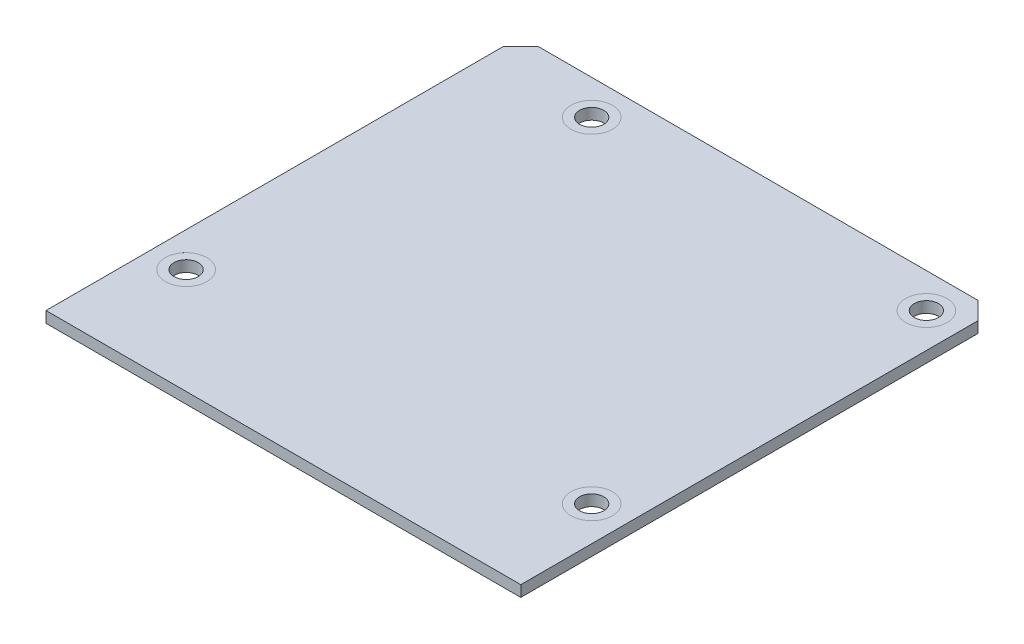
ISO-10303-21;
HEADER;
FILE_DESCRIPTION(('STEP AP214'),'2;1');
FILE_NAME('part.step','',(''),(''),'','','');
FILE_SCHEMA(('AUTOMOTIVE_DESIGN { 1 0 10303 214 1 1 1 1 }'));
ENDSEC;
DATA;
#1=APPLICATION_CONTEXT('core data for automotive mechanical design processes');
#2=APPLICATION_PROTOCOL_DEFINITION('international standard','automotive_design',2000,#1);
#3=PRODUCT_CONTEXT('',#1,'mechanical');
#4=PRODUCT('Part','Part','',(#3));
#5=PRODUCT_RELATED_PRODUCT_CATEGORY('part','',(#4));
#6=PRODUCT_DEFINITION_FORMATION('','',#4);
#7=PRODUCT_DEFINITION_CONTEXT('part definition',#1,'design');
#8=PRODUCT_DEFINITION('design','',#6,#7);
#9=PRODUCT_DEFINITION_SHAPE('','',#8);
#10=(LENGTH_UNIT() NAMED_UNIT(*) SI_UNIT(.MILLI.,.METRE.));
#11=(NAMED_UNIT(*) PLANE_ANGLE_UNIT() SI_UNIT($,.RADIAN.));
#12=(NAMED_UNIT(*) SI_UNIT($,.STERADIAN.) SOLID_ANGLE_UNIT());
#13=UNCERTAINTY_MEASURE_WITH_UNIT(LENGTH_MEASURE(1.E-05),#10,'distance_accuracy_value','');
#14=(GEOMETRIC_REPRESENTATION_CONTEXT(3) GLOBAL_UNCERTAINTY_ASSIGNED_CONTEXT((#13)) GLOBAL_UNIT_ASSIGNED_CONTEXT((#10,
#11,#12)) REPRESENTATION_CONTEXT('',''));
#15=CARTESIAN_POINT('',(0.,0.,0.));
#16=DIRECTION('',(0.,0.,1.));
#17=DIRECTION('',(1.,0.,0.));
#18=AXIS2_PLACEMENT_3D('',#15,#16,#17);
#19=CARTESIAN_POINT('',(29.29,-0.000999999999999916,19.05));
#20=DIRECTION('',(0.,1.,0.));
#21=DIRECTION('',(0.,0.,1.));
#22=AXIS2_PLACEMENT_3D('',#19,#20,#21);
#23=CYLINDRICAL_SURFACE('',#22,1.75);
#24=CARTESIAN_POINT('',(29.29,0.,19.05));
#25=DIRECTION('',(0.,1.,0.));
#26=DIRECTION('',(0.,0.,1.));
#27=AXIS2_PLACEMENT_3D('',#24,#25,#26);
#28=CIRCLE('',#27,1.75);
#29=CARTESIAN_POINT('',(29.29,0.,20.8));
#30=VERTEX_POINT('',#29);
#31=EDGE_CURVE('E169',#30,#30,#28,.F.);
#32=ORIENTED_EDGE('',*,*,#31,.T.);
#33=EDGE_LOOP('',(#32));
#34=FACE_BOUND('',#33,.T.);
#35=CARTESIAN_POINT('',(29.29,1.5999,19.05));
#36=DIRECTION('',(0.,1.,0.));
#37=DIRECTION('',(0.,0.,1.));
#38=AXIS2_PLACEMENT_3D('',#35,#36,#37);
#39=CIRCLE('',#38,1.75);
#40=CARTESIAN_POINT('',(29.29,1.5999,20.8));
#41=VERTEX_POINT('',#40);
#42=EDGE_CURVE('E35',#41,#41,#39,.F.);
#43=ORIENTED_EDGE('',*,*,#42,.F.);
#44=EDGE_LOOP('',(#43));
#45=FACE_BOUND('',#44,.T.);
#46=ADVANCED_FACE('F31',(#34,#45),#23,.F.);
#47=CARTESIAN_POINT('',(-29.29,-0.000999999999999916,19.05));
#48=DIRECTION('',(0.,1.,0.));
#49=DIRECTION('',(0.,0.,1.));
#50=AXIS2_PLACEMENT_3D('',#47,#48,#49);
#51=CYLINDRICAL_SURFACE('',#50,1.75);
#52=CARTESIAN_POINT('',(-29.29,0.,19.05));
#53=DIRECTION('',(0.,1.,0.));
#54=DIRECTION('',(0.,0.,1.));
#55=AXIS2_PLACEMENT_3D('',#52,#53,#54);
#56=CIRCLE('',#55,1.75);
#57=CARTESIAN_POINT('',(-29.29,0.,20.8));
#58=VERTEX_POINT('',#57);
#59=EDGE_CURVE('E136',#58,#58,#56,.F.);
#60=ORIENTED_EDGE('',*,*,#59,.T.);
#61=EDGE_LOOP('',(#60));
#62=FACE_BOUND('',#61,.T.);
#63=CARTESIAN_POINT('',(-29.29,1.5999,19.05));
#64=DIRECTION('',(0.,1.,0.));
#65=DIRECTION('',(0.,0.,1.));
#66=AXIS2_PLACEMENT_3D('',#63,#64,#65);
#67=CIRCLE('',#66,1.75);
#68=CARTESIAN_POINT('',(-29.29,1.5999,20.8));
#69=VERTEX_POINT('',#68);
#70=EDGE_CURVE('E142',#69,#69,#67,.F.);
#71=ORIENTED_EDGE('',*,*,#70,.F.);
#72=EDGE_LOOP('',(#71));
#73=FACE_BOUND('',#72,.T.);
#74=ADVANCED_FACE('F201',(#62,#73),#51,.F.);
#75=CARTESIAN_POINT('',(29.29,-0.000999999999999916,-29.29));
#76=DIRECTION('',(0.,1.,0.));
#77=DIRECTION('',(0.,0.,1.));
#78=AXIS2_PLACEMENT_3D('',#75,#76,#77);
#79=CYLINDRICAL_SURFACE('',#78,1.75);
#80=CARTESIAN_POINT('',(29.29,0.,-29.29));
#81=DIRECTION('',(0.,1.,0.));
#82=DIRECTION('',(0.,0.,1.));
#83=AXIS2_PLACEMENT_3D('',#80,#81,#82);
#84=CIRCLE('',#83,1.75);
#85=CARTESIAN_POINT('',(29.29,0.,-27.54));
#86=VERTEX_POINT('',#85);
#87=EDGE_CURVE('E172',#86,#86,#84,.F.);
#88=ORIENTED_EDGE('',*,*,#87,.T.);
#89=EDGE_LOOP('',(#88));
#90=FACE_BOUND('',#89,.T.);
#91=CARTESIAN_POINT('',(29.29,1.5999,-29.29));
#92=DIRECTION('',(0.,1.,0.));
#93=DIRECTION('',(0.,0.,1.));
#94=AXIS2_PLACEMENT_3D('',#91,#92,#93);
#95=CIRCLE('',#94,1.75);
#96=CARTESIAN_POINT('',(29.29,1.5999,-27.54));
#97=VERTEX_POINT('',#96);
#98=EDGE_CURVE('E138',#97,#97,#95,.F.);
#99=ORIENTED_EDGE('',*,*,#98,.F.);
#100=EDGE_LOOP('',(#99));
#101=FACE_BOUND('',#100,.T.);
#102=ADVANCED_FACE('F207',(#90,#101),#79,.F.);
#103=CARTESIAN_POINT('',(-19.05,-0.000999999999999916,-29.29));
#104=DIRECTION('',(0.,1.,0.));
#105=DIRECTION('',(0.,0.,1.));
#106=AXIS2_PLACEMENT_3D('',#103,#104,#105);
#107=CYLINDRICAL_SURFACE('',#106,1.75);
#108=CARTESIAN_POINT('',(-19.05,0.,-29.29));
#109=DIRECTION('',(0.,1.,0.));
#110=DIRECTION('',(0.,0.,1.));
#111=AXIS2_PLACEMENT_3D('',#108,#109,#110);
#112=CIRCLE('',#111,1.75);
#113=CARTESIAN_POINT('',(-19.05,0.,-27.54));
#114=VERTEX_POINT('',#113);
#115=EDGE_CURVE('E115',#114,#114,#112,.F.);
#116=ORIENTED_EDGE('',*,*,#115,.T.);
#117=EDGE_LOOP('',(#116));
#118=FACE_BOUND('',#117,.T.);
#119=CARTESIAN_POINT('',(-19.05,1.5999,-29.29));
#120=DIRECTION('',(0.,1.,0.));
#121=DIRECTION('',(0.,0.,1.));
#122=AXIS2_PLACEMENT_3D('',#119,#120,#121);
#123=CIRCLE('',#122,1.75);
#124=CARTESIAN_POINT('',(-19.05,1.5999,-27.54));
#125=VERTEX_POINT('',#124);
#126=EDGE_CURVE('E133',#125,#125,#123,.F.);
#127=ORIENTED_EDGE('',*,*,#126,.F.);
#128=EDGE_LOOP('',(#127));
#129=FACE_BOUND('',#128,.T.);
#130=ADVANCED_FACE('F198',(#118,#129),#107,.F.);
#131=CARTESIAN_POINT('',(34.29,1.6,-34.29));
#132=DIRECTION('',(-1.,0.,0.));
#133=DIRECTION('',(0.,0.,1.));
#134=AXIS2_PLACEMENT_3D('',#131,#132,#133);
#135=PLANE('',#134);
#136=DIRECTION('',(0.,0.,-1.));
#137=VECTOR('',#136,1.);
#138=CARTESIAN_POINT('',(34.29,0.,-34.29));
#139=LINE('',#138,#137);
#140=CARTESIAN_POINT('',(34.29,0.,34.29));
#141=VERTEX_POINT('',#140);
#142=CARTESIAN_POINT('',(34.29,0.,-31.75));
#143=VERTEX_POINT('',#142);
#144=EDGE_CURVE('E112',#141,#143,#139,.T.);
#145=ORIENTED_EDGE('',*,*,#144,.T.);
#146=DIRECTION('',(0.,1.,0.));
#147=VECTOR('',#146,1.);
#148=CARTESIAN_POINT('',(34.29,1.6,-31.75));
#149=LINE('',#148,#147);
#150=CARTESIAN_POINT('',(34.29,1.6,-31.75));
#151=VERTEX_POINT('',#150);
#152=EDGE_CURVE('E56',#143,#151,#149,.T.);
#153=ORIENTED_EDGE('',*,*,#152,.T.);
#154=DIRECTION('',(0.,0.,-1.));
#155=VECTOR('',#154,1.);
#156=CARTESIAN_POINT('',(34.29,1.6,-34.29));
#157=LINE('',#156,#155);
#158=CARTESIAN_POINT('',(34.29,1.6,34.29));
#159=VERTEX_POINT('',#158);
#160=EDGE_CURVE('E120',#159,#151,#157,.T.);
#161=ORIENTED_EDGE('',*,*,#160,.F.);
#162=DIRECTION('',(0.,-1.,0.));
#163=VECTOR('',#162,1.);
#164=CARTESIAN_POINT('',(34.29,1.6,34.29));
#165=LINE('',#164,#163);
#166=EDGE_CURVE('E104',#159,#141,#165,.T.);
#167=ORIENTED_EDGE('',*,*,#166,.T.);
#168=EDGE_LOOP('',(#145,#153,#161,#167));
#169=FACE_BOUND('',#168,.T.);
#170=ADVANCED_FACE('F187',(#169),#135,.F.);
#171=CARTESIAN_POINT('',(-34.29,1.6,-34.29));
#172=DIRECTION('',(0.,0.,1.));
#173=DIRECTION('',(1.,0.,0.));
#174=AXIS2_PLACEMENT_3D('',#171,#172,#173);
#175=PLANE('',#174);
#176=DIRECTION('',(-1.,0.,0.));
#177=VECTOR('',#176,1.);
#178=CARTESIAN_POINT('',(-34.29,1.6,-34.29));
#179=LINE('',#178,#177);
#180=CARTESIAN_POINT('',(31.75,1.6,-34.29));
#181=VERTEX_POINT('',#180);
#182=CARTESIAN_POINT('',(-31.75,1.6,-34.29));
#183=VERTEX_POINT('',#182);
#184=EDGE_CURVE('E94',#181,#183,#179,.T.);
#185=ORIENTED_EDGE('',*,*,#184,.F.);
#186=DIRECTION('',(0.,-1.,0.));
#187=VECTOR('',#186,1.);
#188=CARTESIAN_POINT('',(31.75,1.6,-34.29));
#189=LINE('',#188,#187);
#190=CARTESIAN_POINT('',(31.75,0.,-34.29));
#191=VERTEX_POINT('',#190);
#192=EDGE_CURVE('E123',#181,#191,#189,.T.);
#193=ORIENTED_EDGE('',*,*,#192,.T.);
#194=DIRECTION('',(-1.,0.,0.));
#195=VECTOR('',#194,1.);
#196=CARTESIAN_POINT('',(-34.29,0.,-34.29));
#197=LINE('',#196,#195);
#198=CARTESIAN_POINT('',(-31.75,0.,-34.29));
#199=VERTEX_POINT('',#198);
#200=EDGE_CURVE('E114',#191,#199,#197,.T.);
#201=ORIENTED_EDGE('',*,*,#200,.T.);
#202=DIRECTION('',(0.,1.,0.));
#203=VECTOR('',#202,1.);
#204=CARTESIAN_POINT('',(-31.75,1.6,-34.29));
#205=LINE('',#204,#203);
#206=EDGE_CURVE('E103',#199,#183,#205,.T.);
#207=ORIENTED_EDGE('',*,*,#206,.T.);
#208=EDGE_LOOP('',(#185,#193,#201,#207));
#209=FACE_BOUND('',#208,.T.);
#210=ADVANCED_FACE('F190',(#209),#175,.F.);
#211=CARTESIAN_POINT('',(-34.29,1.6,-34.29));
#212=DIRECTION('',(1.,0.,0.));
#213=DIRECTION('',(0.,0.,-1.));
#214=AXIS2_PLACEMENT_3D('',#211,#212,#213);
#215=PLANE('',#214);
#216=DIRECTION('',(0.,0.,1.));
#217=VECTOR('',#216,1.);
#218=CARTESIAN_POINT('',(-34.29,1.6,-34.29));
#219=LINE('',#218,#217);
#220=CARTESIAN_POINT('',(-34.29,1.6,-31.75));
#221=VERTEX_POINT('',#220);
#222=CARTESIAN_POINT('',(-34.29,1.6,34.29));
#223=VERTEX_POINT('',#222);
#224=EDGE_CURVE('E86',#221,#223,#219,.T.);
#225=ORIENTED_EDGE('',*,*,#224,.F.);
#226=DIRECTION('',(0.,-1.,0.));
#227=VECTOR('',#226,1.);
#228=CARTESIAN_POINT('',(-34.29,1.6,-31.75));
#229=LINE('',#228,#227);
#230=CARTESIAN_POINT('',(-34.29,0.,-31.75));
#231=VERTEX_POINT('',#230);
#232=EDGE_CURVE('E11',#221,#231,#229,.T.);
#233=ORIENTED_EDGE('',*,*,#232,.T.);
#234=DIRECTION('',(0.,0.,1.));
#235=VECTOR('',#234,1.);
#236=CARTESIAN_POINT('',(-34.29,0.,-34.29));
#237=LINE('',#236,#235);
#238=CARTESIAN_POINT('',(-34.29,0.,34.29));
#239=VERTEX_POINT('',#238);
#240=EDGE_CURVE('E100',#231,#239,#237,.T.);
#241=ORIENTED_EDGE('',*,*,#240,.T.);
#242=DIRECTION('',(0.,-1.,0.));
#243=VECTOR('',#242,1.);
#244=CARTESIAN_POINT('',(-34.29,1.6,34.29));
#245=LINE('',#244,#243);
#246=EDGE_CURVE('E97',#223,#239,#245,.T.);
#247=ORIENTED_EDGE('',*,*,#246,.F.);
#248=EDGE_LOOP('',(#225,#233,#241,#247));
#249=FACE_BOUND('',#248,.T.);
#250=ADVANCED_FACE('F98',(#249),#215,.F.);
#251=CARTESIAN_POINT('',(-34.29,1.6,34.29));
#252=DIRECTION('',(0.,0.,-1.));
#253=DIRECTION('',(-1.,0.,0.));
#254=AXIS2_PLACEMENT_3D('',#251,#252,#253);
#255=PLANE('',#254);
#256=DIRECTION('',(1.,0.,0.));
#257=VECTOR('',#256,1.);
#258=CARTESIAN_POINT('',(-34.29,0.,34.29));
#259=LINE('',#258,#257);
#260=EDGE_CURVE('E119',#239,#141,#259,.T.);
#261=ORIENTED_EDGE('',*,*,#260,.T.);
#262=ORIENTED_EDGE('',*,*,#166,.F.);
#263=DIRECTION('',(1.,0.,0.));
#264=VECTOR('',#263,1.);
#265=CARTESIAN_POINT('',(-34.29,1.6,34.29));
#266=LINE('',#265,#264);
#267=EDGE_CURVE('E90',#223,#159,#266,.T.);
#268=ORIENTED_EDGE('',*,*,#267,.F.);
#269=ORIENTED_EDGE('',*,*,#246,.T.);
#270=EDGE_LOOP('',(#261,#262,#268,#269));
#271=FACE_BOUND('',#270,.T.);
#272=ADVANCED_FACE('F106',(#271),#255,.F.);
#273=CARTESIAN_POINT('',(34.29,1.6,34.29));
#274=DIRECTION('',(0.,1.,0.));
#275=DIRECTION('',(0.,0.,1.));
#276=AXIS2_PLACEMENT_3D('',#273,#274,#275);
#277=PLANE('',#276);
#278=CARTESIAN_POINT('',(29.29,1.6,19.05));
#279=DIRECTION('',(0.,1.,0.));
#280=DIRECTION('',(0.,0.,1.));
#281=AXIS2_PLACEMENT_3D('',#278,#279,#280);
#282=CIRCLE('',#281,3.);
#283=CARTESIAN_POINT('',(29.29,1.6,22.05));
#284=VERTEX_POINT('',#283);
#285=EDGE_CURVE('E158',#284,#284,#282,.T.);
#286=ORIENTED_EDGE('',*,*,#285,.F.);
#287=EDGE_LOOP('',(#286));
#288=FACE_BOUND('',#287,.T.);
#289=CARTESIAN_POINT('',(-29.29,1.6,19.05));
#290=DIRECTION('',(0.,1.,0.));
#291=DIRECTION('',(0.,0.,1.));
#292=AXIS2_PLACEMENT_3D('',#289,#290,#291);
#293=CIRCLE('',#292,3.);
#294=CARTESIAN_POINT('',(-29.29,1.6,22.05));
#295=VERTEX_POINT('',#294);
#296=EDGE_CURVE('E151',#295,#295,#293,.T.);
#297=ORIENTED_EDGE('',*,*,#296,.F.);
#298=EDGE_LOOP('',(#297));
#299=FACE_BOUND('',#298,.T.);
#300=CARTESIAN_POINT('',(29.29,1.6,-29.29));
#301=DIRECTION('',(0.,1.,0.));
#302=DIRECTION('',(0.,0.,1.));
#303=AXIS2_PLACEMENT_3D('',#300,#301,#302);
#304=CIRCLE('',#303,3.);
#305=CARTESIAN_POINT('',(29.29,1.6,-26.29));
#306=VERTEX_POINT('',#305);
#307=EDGE_CURVE('E144',#306,#306,#304,.T.);
#308=ORIENTED_EDGE('',*,*,#307,.F.);
#309=EDGE_LOOP('',(#308));
#310=FACE_BOUND('',#309,.T.);
#311=CARTESIAN_POINT('',(-19.05,1.6,-29.29));
#312=DIRECTION('',(0.,1.,0.));
#313=DIRECTION('',(0.,0.,1.));
#314=AXIS2_PLACEMENT_3D('',#311,#312,#313);
#315=CIRCLE('',#314,3.);
#316=CARTESIAN_POINT('',(-19.05,1.6,-26.29));
#317=VERTEX_POINT('',#316);
#318=EDGE_CURVE('E140',#317,#317,#315,.T.);
#319=ORIENTED_EDGE('',*,*,#318,.F.);
#320=EDGE_LOOP('',(#319));
#321=FACE_BOUND('',#320,.T.);
#322=ORIENTED_EDGE('',*,*,#160,.T.);
#323=DIRECTION('',(0.707106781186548,0.,0.707106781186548));
#324=VECTOR('',#323,1.);
#325=CARTESIAN_POINT('',(67.31,1.6,1.27));
#326=LINE('',#325,#324);
#327=EDGE_CURVE('E40',#151,#181,#326,.F.);
#328=ORIENTED_EDGE('',*,*,#327,.T.);
#329=ORIENTED_EDGE('',*,*,#184,.T.);
#330=DIRECTION('',(0.707106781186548,0.,-0.707106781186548));
#331=VECTOR('',#330,1.);
#332=CARTESIAN_POINT('',(-33.02,1.6,-33.02));
#333=LINE('',#332,#331);
#334=EDGE_CURVE('E48',#183,#221,#333,.F.);
#335=ORIENTED_EDGE('',*,*,#334,.T.);
#336=ORIENTED_EDGE('',*,*,#224,.T.);
#337=ORIENTED_EDGE('',*,*,#267,.T.);
#338=EDGE_LOOP('',(#322,#328,#329,#335,#336,#337));
#339=FACE_BOUND('',#338,.T.);
#340=ADVANCED_FACE('F88',(#288,#299,#310,#321,#339),#277,.T.);
#341=CARTESIAN_POINT('',(34.29,0.,34.29));
#342=DIRECTION('',(0.,1.,0.));
#343=DIRECTION('',(0.,0.,1.));
#344=AXIS2_PLACEMENT_3D('',#341,#342,#343);
#345=PLANE('',#344);
#346=ORIENTED_EDGE('',*,*,#59,.F.);
#347=EDGE_LOOP('',(#346));
#348=FACE_BOUND('',#347,.T.);
#349=ORIENTED_EDGE('',*,*,#31,.F.);
#350=EDGE_LOOP('',(#349));
#351=FACE_BOUND('',#350,.T.);
#352=ORIENTED_EDGE('',*,*,#87,.F.);
#353=EDGE_LOOP('',(#352));
#354=FACE_BOUND('',#353,.T.);
#355=ORIENTED_EDGE('',*,*,#115,.F.);
#356=EDGE_LOOP('',(#355));
#357=FACE_BOUND('',#356,.T.);
#358=ORIENTED_EDGE('',*,*,#200,.F.);
#359=DIRECTION('',(-0.707106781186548,0.,-0.707106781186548));
#360=VECTOR('',#359,1.);
#361=CARTESIAN_POINT('',(31.75,0.,-34.29));
#362=LINE('',#361,#360);
#363=EDGE_CURVE('E128',#191,#143,#362,.F.);
#364=ORIENTED_EDGE('',*,*,#363,.T.);
#365=ORIENTED_EDGE('',*,*,#144,.F.);
#366=ORIENTED_EDGE('',*,*,#260,.F.);
#367=ORIENTED_EDGE('',*,*,#240,.F.);
#368=DIRECTION('',(-0.707106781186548,0.,0.707106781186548));
#369=VECTOR('',#368,1.);
#370=CARTESIAN_POINT('',(-34.29,0.,-31.75));
#371=LINE('',#370,#369);
#372=EDGE_CURVE('E126',#231,#199,#371,.F.);
#373=ORIENTED_EDGE('',*,*,#372,.T.);
#374=EDGE_LOOP('',(#358,#364,#365,#366,#367,#373));
#375=FACE_BOUND('',#374,.T.);
#376=ADVANCED_FACE('F185',(#348,#351,#354,#357,#375),#345,.F.);
#377=CARTESIAN_POINT('',(31.75,1.6,-34.29));
#378=DIRECTION('',(-0.707106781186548,0.,0.707106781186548));
#379=DIRECTION('',(0.707106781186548,0.,0.707106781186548));
#380=AXIS2_PLACEMENT_3D('',#377,#378,#379);
#381=PLANE('',#380);
#382=ORIENTED_EDGE('',*,*,#327,.F.);
#383=ORIENTED_EDGE('',*,*,#152,.F.);
#384=ORIENTED_EDGE('',*,*,#363,.F.);
#385=ORIENTED_EDGE('',*,*,#192,.F.);
#386=EDGE_LOOP('',(#382,#383,#384,#385));
#387=FACE_BOUND('',#386,.T.);
#388=ADVANCED_FACE('F189',(#387),#381,.F.);
#389=CARTESIAN_POINT('',(-34.29,1.6,-31.75));
#390=DIRECTION('',(0.707106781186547,0.,0.707106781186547));
#391=DIRECTION('',(0.707106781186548,0.,-0.707106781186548));
#392=AXIS2_PLACEMENT_3D('',#389,#390,#391);
#393=PLANE('',#392);
#394=ORIENTED_EDGE('',*,*,#334,.F.);
#395=ORIENTED_EDGE('',*,*,#206,.F.);
#396=ORIENTED_EDGE('',*,*,#372,.F.);
#397=ORIENTED_EDGE('',*,*,#232,.F.);
#398=EDGE_LOOP('',(#394,#395,#396,#397));
#399=FACE_BOUND('',#398,.T.);
#400=ADVANCED_FACE('F33',(#399),#393,.F.);
#401=CARTESIAN_POINT('',(-19.05,1.5999,-29.29));
#402=DIRECTION('',(0.,1.,0.));
#403=DIRECTION('',(0.,0.,1.));
#404=AXIS2_PLACEMENT_3D('',#401,#402,#403);
#405=PLANE('',#404);
#406=CARTESIAN_POINT('',(-19.05,1.5999,-29.29));
#407=DIRECTION('',(0.,1.,0.));
#408=DIRECTION('',(0.,0.,1.));
#409=AXIS2_PLACEMENT_3D('',#406,#407,#408);
#410=CIRCLE('',#409,3.);
#411=CARTESIAN_POINT('',(-19.05,1.5999,-26.29));
#412=VERTEX_POINT('',#411);
#413=EDGE_CURVE('E137',#412,#412,#410,.T.);
#414=ORIENTED_EDGE('',*,*,#413,.T.);
#415=EDGE_LOOP('',(#414));
#416=FACE_BOUND('',#415,.T.);
#417=ORIENTED_EDGE('',*,*,#126,.T.);
#418=EDGE_LOOP('',(#417));
#419=FACE_BOUND('',#418,.T.);
#420=ADVANCED_FACE('F252',(#416,#419),#405,.T.);
#421=CARTESIAN_POINT('',(-19.05,1.5999,-29.29));
#422=DIRECTION('',(0.,1.,0.));
#423=DIRECTION('',(0.,0.,1.));
#424=AXIS2_PLACEMENT_3D('',#421,#422,#423);
#425=CYLINDRICAL_SURFACE('',#424,3.);
#426=ORIENTED_EDGE('',*,*,#413,.F.);
#427=EDGE_LOOP('',(#426));
#428=FACE_BOUND('',#427,.T.);
#429=ORIENTED_EDGE('',*,*,#318,.T.);
#430=EDGE_LOOP('',(#429));
#431=FACE_BOUND('',#430,.T.);
#432=ADVANCED_FACE('F257',(#428,#431),#425,.F.);
#433=CARTESIAN_POINT('',(29.29,1.5999,-29.29));
#434=DIRECTION('',(0.,1.,0.));
#435=DIRECTION('',(0.,0.,1.));
#436=AXIS2_PLACEMENT_3D('',#433,#434,#435);
#437=PLANE('',#436);
#438=CARTESIAN_POINT('',(29.29,1.5999,-29.29));
#439=DIRECTION('',(0.,1.,0.));
#440=DIRECTION('',(0.,0.,1.));
#441=AXIS2_PLACEMENT_3D('',#438,#439,#440);
#442=CIRCLE('',#441,3.);
#443=CARTESIAN_POINT('',(29.29,1.5999,-26.29));
#444=VERTEX_POINT('',#443);
#445=EDGE_CURVE('E141',#444,#444,#442,.T.);
#446=ORIENTED_EDGE('',*,*,#445,.T.);
#447=EDGE_LOOP('',(#446));
#448=FACE_BOUND('',#447,.T.);
#449=ORIENTED_EDGE('',*,*,#98,.T.);
#450=EDGE_LOOP('',(#449));
#451=FACE_BOUND('',#450,.T.);
#452=ADVANCED_FACE('F265',(#448,#451),#437,.T.);
#453=CARTESIAN_POINT('',(29.29,1.5999,-29.29));
#454=DIRECTION('',(0.,1.,0.));
#455=DIRECTION('',(0.,0.,1.));
#456=AXIS2_PLACEMENT_3D('',#453,#454,#455);
#457=CYLINDRICAL_SURFACE('',#456,3.);
#458=ORIENTED_EDGE('',*,*,#445,.F.);
#459=EDGE_LOOP('',(#458));
#460=FACE_BOUND('',#459,.T.);
#461=ORIENTED_EDGE('',*,*,#307,.T.);
#462=EDGE_LOOP('',(#461));
#463=FACE_BOUND('',#462,.T.);
#464=ADVANCED_FACE('F272',(#460,#463),#457,.F.);
#465=CARTESIAN_POINT('',(-29.29,1.5999,19.05));
#466=DIRECTION('',(0.,1.,0.));
#467=DIRECTION('',(0.,0.,1.));
#468=AXIS2_PLACEMENT_3D('',#465,#466,#467);
#469=PLANE('',#468);
#470=CARTESIAN_POINT('',(-29.29,1.5999,19.05));
#471=DIRECTION('',(0.,1.,0.));
#472=DIRECTION('',(0.,0.,1.));
#473=AXIS2_PLACEMENT_3D('',#470,#471,#472);
#474=CIRCLE('',#473,3.);
#475=CARTESIAN_POINT('',(-29.29,1.5999,22.05));
#476=VERTEX_POINT('',#475);
#477=EDGE_CURVE('E145',#476,#476,#474,.T.);
#478=ORIENTED_EDGE('',*,*,#477,.T.);
#479=EDGE_LOOP('',(#478));
#480=FACE_BOUND('',#479,.T.);
#481=ORIENTED_EDGE('',*,*,#70,.T.);
#482=EDGE_LOOP('',(#481));
#483=FACE_BOUND('',#482,.T.);
#484=ADVANCED_FACE('F280',(#480,#483),#469,.T.);
#485=CARTESIAN_POINT('',(-29.29,1.5999,19.05));
#486=DIRECTION('',(0.,1.,0.));
#487=DIRECTION('',(0.,0.,1.));
#488=AXIS2_PLACEMENT_3D('',#485,#486,#487);
#489=CYLINDRICAL_SURFACE('',#488,3.);
#490=ORIENTED_EDGE('',*,*,#477,.F.);
#491=EDGE_LOOP('',(#490));
#492=FACE_BOUND('',#491,.T.);
#493=ORIENTED_EDGE('',*,*,#296,.T.);
#494=EDGE_LOOP('',(#493));
#495=FACE_BOUND('',#494,.T.);
#496=ADVANCED_FACE('F288',(#492,#495),#489,.F.);
#497=CARTESIAN_POINT('',(29.29,1.5999,19.05));
#498=DIRECTION('',(0.,1.,0.));
#499=DIRECTION('',(0.,0.,1.));
#500=AXIS2_PLACEMENT_3D('',#497,#498,#499);
#501=PLANE('',#500);
#502=CARTESIAN_POINT('',(29.29,1.5999,19.05));
#503=DIRECTION('',(0.,1.,0.));
#504=DIRECTION('',(0.,0.,1.));
#505=AXIS2_PLACEMENT_3D('',#502,#503,#504);
#506=CIRCLE('',#505,3.);
#507=CARTESIAN_POINT('',(29.29,1.5999,22.05));
#508=VERTEX_POINT('',#507);
#509=EDGE_CURVE('E377',#508,#508,#506,.T.);
#510=ORIENTED_EDGE('',*,*,#509,.T.);
#511=EDGE_LOOP('',(#510));
#512=FACE_BOUND('',#511,.T.);
#513=ORIENTED_EDGE('',*,*,#42,.T.);
#514=EDGE_LOOP('',(#513));
#515=FACE_BOUND('',#514,.T.);
#516=ADVANCED_FACE('F295',(#512,#515),#501,.T.);
#517=CARTESIAN_POINT('',(29.29,1.5999,19.05));
#518=DIRECTION('',(0.,1.,0.));
#519=DIRECTION('',(0.,0.,1.));
#520=AXIS2_PLACEMENT_3D('',#517,#518,#519);
#521=CYLINDRICAL_SURFACE('',#520,3.);
#522=ORIENTED_EDGE('',*,*,#509,.F.);
#523=EDGE_LOOP('',(#522));
#524=FACE_BOUND('',#523,.T.);
#525=ORIENTED_EDGE('',*,*,#285,.T.);
#526=EDGE_LOOP('',(#525));
#527=FACE_BOUND('',#526,.T.);
#528=ADVANCED_FACE('F303',(#524,#527),#521,.F.);
#529=CLOSED_SHELL('',(#46,#74,#102,#130,#170,#210,#250,#272,#340,#376,#388,#400,#420,#432,#452,
#464,#484,#496,#516,#528));
#530=MANIFOLD_SOLID_BREP('B2',#529);
#531=ADVANCED_BREP_SHAPE_REPRESENTATION('',(#18,#530),#14);
#532=SHAPE_DEFINITION_REPRESENTATION(#9,#531);
ENDSEC;
END-ISO-10303-21;
